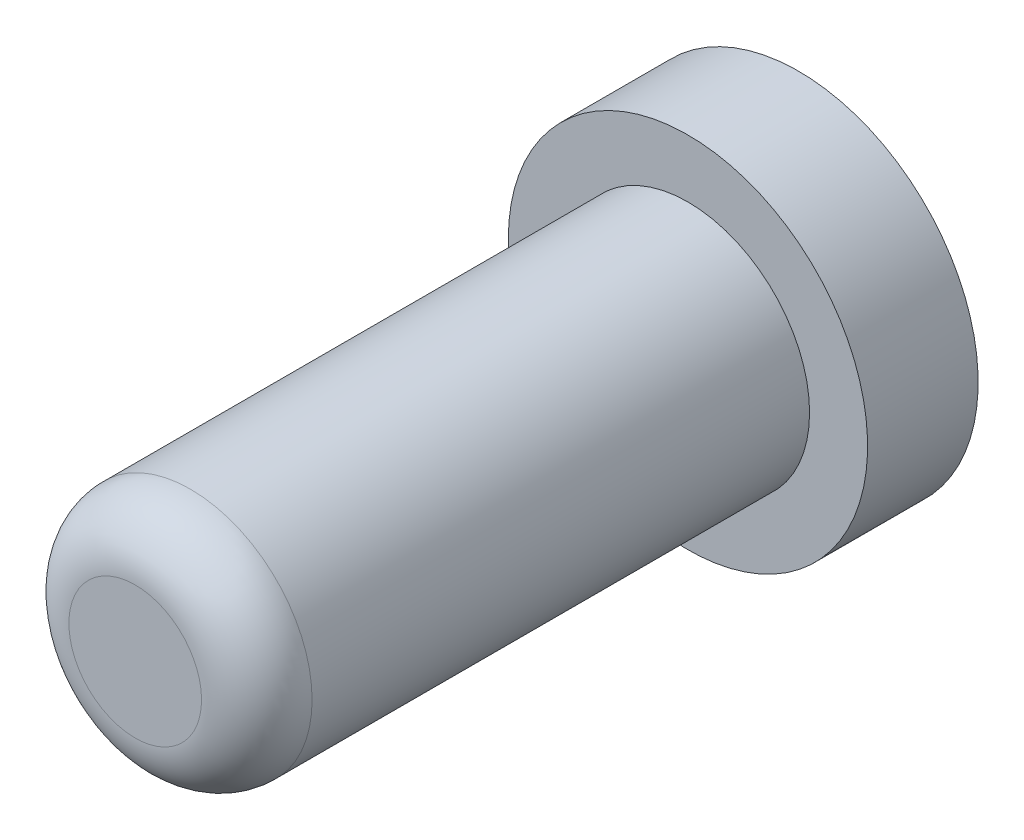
ISO-10303-21;
HEADER;
FILE_DESCRIPTION(('STEP AP214'),'2;1');
FILE_NAME('part.step','',(''),(''),'','','');
FILE_SCHEMA(('AUTOMOTIVE_DESIGN { 1 0 10303 214 1 1 1 1 }'));
ENDSEC;
DATA;
#1=APPLICATION_CONTEXT('core data for automotive mechanical design processes');
#2=APPLICATION_PROTOCOL_DEFINITION('international standard','automotive_design',2000,#1);
#3=PRODUCT_CONTEXT('',#1,'mechanical');
#4=PRODUCT('Part','Part','',(#3));
#5=PRODUCT_RELATED_PRODUCT_CATEGORY('part','',(#4));
#6=PRODUCT_DEFINITION_FORMATION('','',#4);
#7=PRODUCT_DEFINITION_CONTEXT('part definition',#1,'design');
#8=PRODUCT_DEFINITION('design','',#6,#7);
#9=PRODUCT_DEFINITION_SHAPE('','',#8);
#10=(LENGTH_UNIT() NAMED_UNIT(*) SI_UNIT(.MILLI.,.METRE.));
#11=(NAMED_UNIT(*) PLANE_ANGLE_UNIT() SI_UNIT($,.RADIAN.));
#12=(NAMED_UNIT(*) SI_UNIT($,.STERADIAN.) SOLID_ANGLE_UNIT());
#13=UNCERTAINTY_MEASURE_WITH_UNIT(LENGTH_MEASURE(1.E-05),#10,'distance_accuracy_value','');
#14=(GEOMETRIC_REPRESENTATION_CONTEXT(3) GLOBAL_UNCERTAINTY_ASSIGNED_CONTEXT((#13)) GLOBAL_UNIT_ASSIGNED_CONTEXT((#10,
#11,#12)) REPRESENTATION_CONTEXT('',''));
#15=CARTESIAN_POINT('',(0.,0.,0.));
#16=DIRECTION('',(0.,0.,1.));
#17=DIRECTION('',(1.,0.,0.));
#18=AXIS2_PLACEMENT_3D('',#15,#16,#17);
#19=CARTESIAN_POINT('',(70.9607,2.47050000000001,47.5));
#20=DIRECTION('',(0.,0.,-1.));
#21=DIRECTION('',(-1.,0.,0.));
#22=AXIS2_PLACEMENT_3D('',#19,#20,#21);
#23=CYLINDRICAL_SURFACE('',#22,4.4);
#24=CARTESIAN_POINT('',(70.9607,2.47050000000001,45.5));
#25=DIRECTION('',(0.,0.,1.));
#26=DIRECTION('',(1.,0.,0.));
#27=AXIS2_PLACEMENT_3D('',#24,#25,#26);
#28=CIRCLE('',#27,4.4);
#29=CARTESIAN_POINT('',(75.3607,2.47050000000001,45.5));
#30=VERTEX_POINT('',#29);
#31=EDGE_CURVE('E10',#30,#30,#28,.F.);
#32=ORIENTED_EDGE('',*,*,#31,.T.);
#33=EDGE_LOOP('',(#32));
#34=FACE_BOUND('',#33,.T.);
#35=CARTESIAN_POINT('',(70.9607,2.47050000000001,27.5));
#36=DIRECTION('',(0.,0.,1.));
#37=DIRECTION('',(1.,0.,0.));
#38=AXIS2_PLACEMENT_3D('',#35,#36,#37);
#39=CIRCLE('',#38,4.4);
#40=CARTESIAN_POINT('',(75.3607,2.47050000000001,27.5));
#41=VERTEX_POINT('',#40);
#42=EDGE_CURVE('E52',#41,#41,#39,.T.);
#43=ORIENTED_EDGE('',*,*,#42,.T.);
#44=EDGE_LOOP('',(#43));
#45=FACE_BOUND('',#44,.T.);
#46=ADVANCED_FACE('F41',(#34,#45),#23,.T.);
#47=CARTESIAN_POINT('',(70.9607,2.47050000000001,47.5));
#48=DIRECTION('',(0.,0.,1.));
#49=DIRECTION('',(1.,0.,0.));
#50=AXIS2_PLACEMENT_3D('',#47,#48,#49);
#51=PLANE('',#50);
#52=CARTESIAN_POINT('',(70.9607,2.47050000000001,47.5));
#53=DIRECTION('',(0.,0.,1.));
#54=DIRECTION('',(1.,0.,0.));
#55=AXIS2_PLACEMENT_3D('',#52,#53,#54);
#56=CIRCLE('',#55,2.4);
#57=CARTESIAN_POINT('',(73.3607,2.47050000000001,47.5));
#58=VERTEX_POINT('',#57);
#59=EDGE_CURVE('E48',#58,#58,#56,.T.);
#60=ORIENTED_EDGE('',*,*,#59,.T.);
#61=EDGE_LOOP('',(#60));
#62=FACE_BOUND('',#61,.T.);
#63=ADVANCED_FACE('F84',(#62),#51,.T.);
#64=CARTESIAN_POINT('',(70.9607,2.47050000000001,45.5));
#65=DIRECTION('',(0.,0.,1.));
#66=DIRECTION('',(1.,0.,0.));
#67=AXIS2_PLACEMENT_3D('',#64,#65,#66);
#68=TOROIDAL_SURFACE('',#67,2.4,2.);
#69=ORIENTED_EDGE('',*,*,#31,.F.);
#70=EDGE_LOOP('',(#69));
#71=FACE_BOUND('',#70,.T.);
#72=ORIENTED_EDGE('',*,*,#59,.F.);
#73=EDGE_LOOP('',(#72));
#74=FACE_BOUND('',#73,.T.);
#75=ADVANCED_FACE('F43',(#71,#74),#68,.T.);
#76=CARTESIAN_POINT('',(70.9607,2.47050000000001,23.5));
#77=DIRECTION('',(0.,0.,1.));
#78=DIRECTION('',(1.,0.,0.));
#79=AXIS2_PLACEMENT_3D('',#76,#77,#78);
#80=CYLINDRICAL_SURFACE('',#79,6.49999999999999);
#81=CARTESIAN_POINT('',(70.9607,2.47050000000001,23.5));
#82=DIRECTION('',(0.,0.,-1.));
#83=DIRECTION('',(-1.,0.,0.));
#84=AXIS2_PLACEMENT_3D('',#81,#82,#83);
#85=CIRCLE('',#84,6.49999999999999);
#86=CARTESIAN_POINT('',(64.4607,2.47050000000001,23.5));
#87=VERTEX_POINT('',#86);
#88=EDGE_CURVE('E56',#87,#87,#85,.T.);
#89=ORIENTED_EDGE('',*,*,#88,.F.);
#90=EDGE_LOOP('',(#89));
#91=FACE_BOUND('',#90,.T.);
#92=CARTESIAN_POINT('',(70.9607,2.47050000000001,27.5));
#93=DIRECTION('',(0.,0.,-1.));
#94=DIRECTION('',(-1.,0.,0.));
#95=AXIS2_PLACEMENT_3D('',#92,#93,#94);
#96=CIRCLE('',#95,6.49999999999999);
#97=CARTESIAN_POINT('',(64.4607,2.47050000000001,27.5));
#98=VERTEX_POINT('',#97);
#99=EDGE_CURVE('E59',#98,#98,#96,.T.);
#100=ORIENTED_EDGE('',*,*,#99,.T.);
#101=EDGE_LOOP('',(#100));
#102=FACE_BOUND('',#101,.T.);
#103=ADVANCED_FACE('F67',(#91,#102),#80,.T.);
#104=CARTESIAN_POINT('',(70.9607,2.47050000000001,23.5));
#105=DIRECTION('',(0.,0.,-1.));
#106=DIRECTION('',(-1.,0.,0.));
#107=AXIS2_PLACEMENT_3D('',#104,#105,#106);
#108=PLANE('',#107);
#109=ORIENTED_EDGE('',*,*,#88,.T.);
#110=EDGE_LOOP('',(#109));
#111=FACE_BOUND('',#110,.T.);
#112=ADVANCED_FACE('F65',(#111),#108,.T.);
#113=CARTESIAN_POINT('',(70.9607,2.47050000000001,27.5));
#114=DIRECTION('',(0.,0.,-1.));
#115=DIRECTION('',(-1.,0.,0.));
#116=AXIS2_PLACEMENT_3D('',#113,#114,#115);
#117=PLANE('',#116);
#118=ORIENTED_EDGE('',*,*,#42,.F.);
#119=EDGE_LOOP('',(#118));
#120=FACE_BOUND('',#119,.T.);
#121=ORIENTED_EDGE('',*,*,#99,.F.);
#122=EDGE_LOOP('',(#121));
#123=FACE_BOUND('',#122,.T.);
#124=ADVANCED_FACE('F73',(#120,#123),#117,.F.);
#125=CLOSED_SHELL('',(#46,#63,#75,#103,#112,#124));
#126=MANIFOLD_SOLID_BREP('B2',#125);
#127=ADVANCED_BREP_SHAPE_REPRESENTATION('',(#18,#126),#14);
#128=SHAPE_DEFINITION_REPRESENTATION(#9,#127);
ENDSEC;
END-ISO-10303-21;
